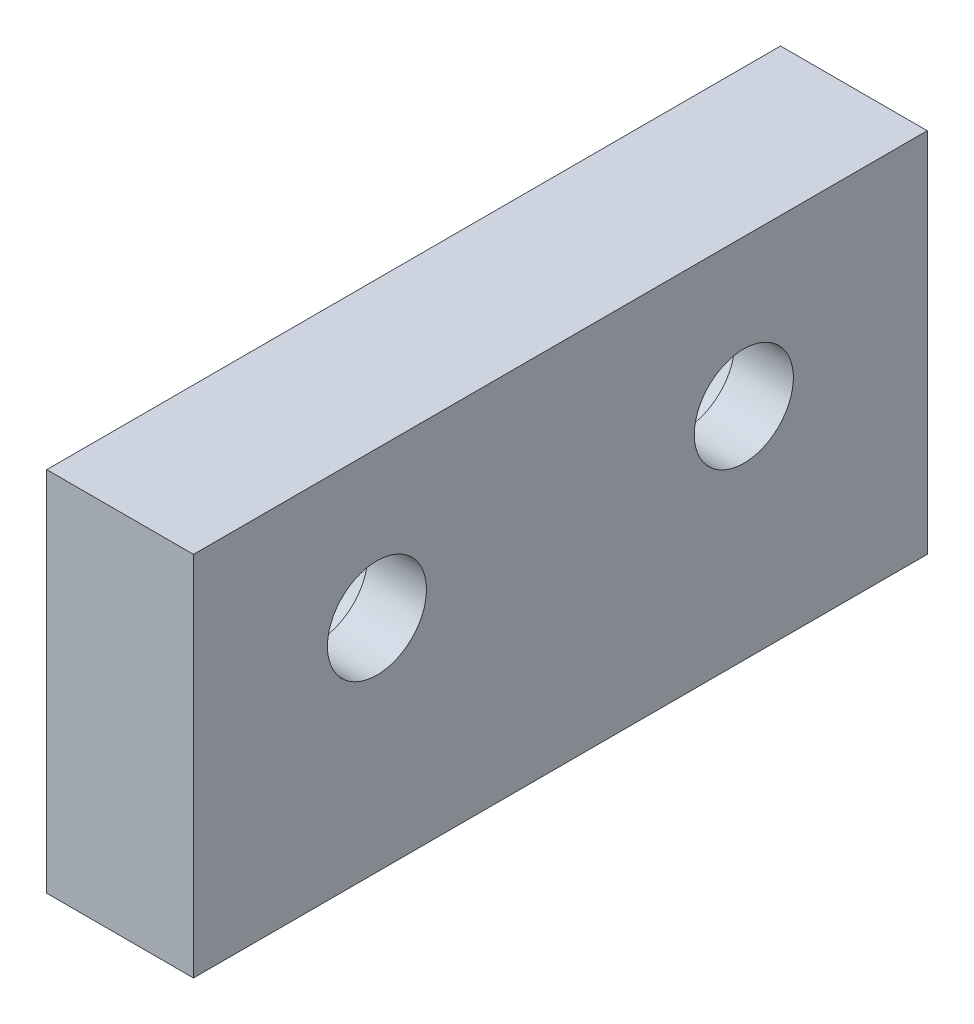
from build123d import *

# Parameters (mm, degrees)
BOSS_EXTRU_1_DEPTH                                 = 75
BOSS_EXTRU_1_DEPTH_BACK                            = 25
ESQUISSE1_W                                        = 20
ESQUISSE1_H                                        = 50
CHAMBRAGE_POUR_VIS_T_TE_HEXAGONALE_M12_D           = 13.5
CHAMBRAGE_POUR_VIS_T_TE_HEXAGONALE_M12_CBORE_D     = 20
CHAMBRAGE_POUR_VIS_T_TE_HEXAGONALE_M12_CBORE_DEPTH = 12


with BuildPart() as part:
    # Esquisse1 → Boss.-Extru.1 (new, two sides: drawn at the far end of the back side and taken through both)
    with BuildSketch(Plane.XY.offset(-BOSS_EXTRU_1_DEPTH_BACK)):
        with Locations((-10, -5)):
            Rectangle(ESQUISSE1_W, ESQUISSE1_H)
    extrude(amount=BOSS_EXTRU_1_DEPTH + BOSS_EXTRU_1_DEPTH_BACK)

    # Chambrage pour vis _ t_te hexagonale M12 (through all)
    with Locations(Plane.ZY.offset(20)):
        with Locations((0, 0), (50, 0)):
            CounterBoreHole(CHAMBRAGE_POUR_VIS_T_TE_HEXAGONALE_M12_D / 2, CHAMBRAGE_POUR_VIS_T_TE_HEXAGONALE_M12_CBORE_D / 2, CHAMBRAGE_POUR_VIS_T_TE_HEXAGONALE_M12_CBORE_DEPTH)


solid = part.part
